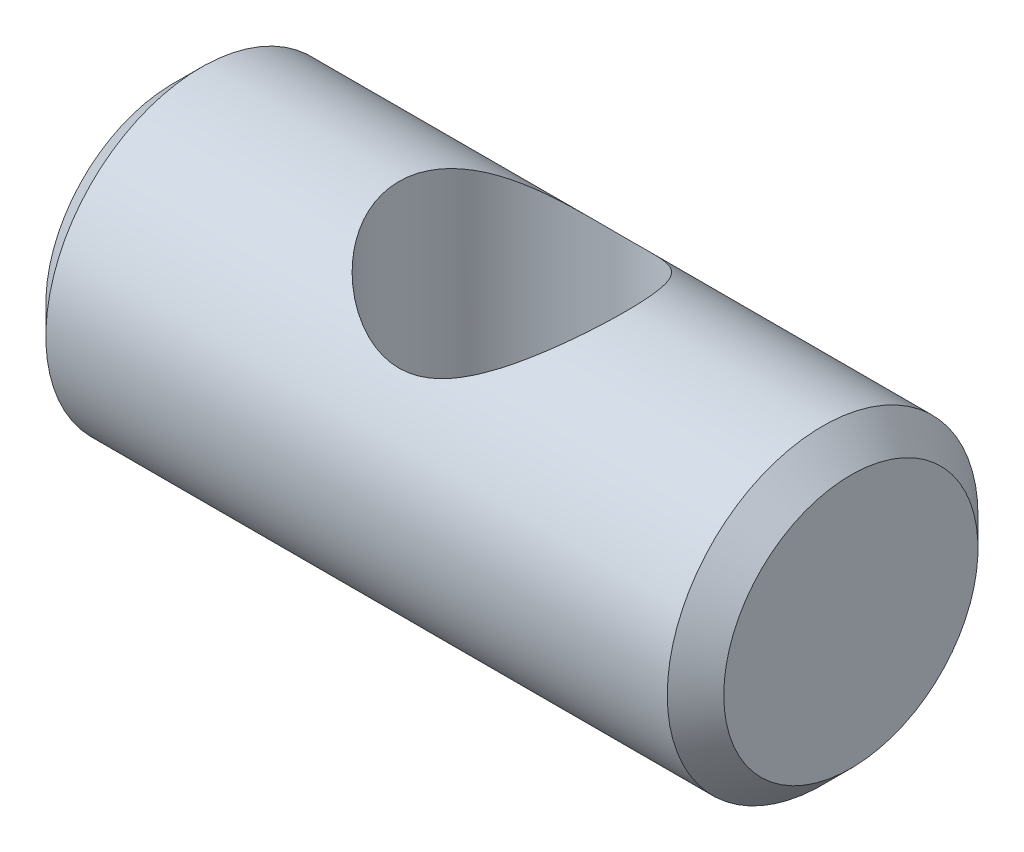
ISO-10303-21;
HEADER;
FILE_DESCRIPTION(('STEP AP214'),'2;1');
FILE_NAME('part.step','',(''),(''),'','','');
FILE_SCHEMA(('AUTOMOTIVE_DESIGN { 1 0 10303 214 1 1 1 1 }'));
ENDSEC;
DATA;
#1=APPLICATION_CONTEXT('core data for automotive mechanical design processes');
#2=APPLICATION_PROTOCOL_DEFINITION('international standard','automotive_design',2000,#1);
#3=PRODUCT_CONTEXT('',#1,'mechanical');
#4=PRODUCT('Part','Part','',(#3));
#5=PRODUCT_RELATED_PRODUCT_CATEGORY('part','',(#4));
#6=PRODUCT_DEFINITION_FORMATION('','',#4);
#7=PRODUCT_DEFINITION_CONTEXT('part definition',#1,'design');
#8=PRODUCT_DEFINITION('design','',#6,#7);
#9=PRODUCT_DEFINITION_SHAPE('','',#8);
#10=(LENGTH_UNIT() NAMED_UNIT(*) SI_UNIT(.MILLI.,.METRE.));
#11=(NAMED_UNIT(*) PLANE_ANGLE_UNIT() SI_UNIT($,.RADIAN.));
#12=(NAMED_UNIT(*) SI_UNIT($,.STERADIAN.) SOLID_ANGLE_UNIT());
#13=UNCERTAINTY_MEASURE_WITH_UNIT(LENGTH_MEASURE(1.E-05),#10,'distance_accuracy_value','');
#14=(GEOMETRIC_REPRESENTATION_CONTEXT(3) GLOBAL_UNCERTAINTY_ASSIGNED_CONTEXT((#13)) GLOBAL_UNIT_ASSIGNED_CONTEXT((#10,
#11,#12)) REPRESENTATION_CONTEXT('',''));
#15=CARTESIAN_POINT('',(0.,0.,0.));
#16=DIRECTION('',(0.,0.,1.));
#17=DIRECTION('',(1.,0.,0.));
#18=AXIS2_PLACEMENT_3D('',#15,#16,#17);
#19=CARTESIAN_POINT('',(12.,4.5,0.));
#20=DIRECTION('',(-1.,0.,0.));
#21=DIRECTION('',(0.,0.,1.));
#22=AXIS2_PLACEMENT_3D('',#19,#20,#21);
#23=PLANE('',#22);
#24=CARTESIAN_POINT('',(12.0000000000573,0.,0.));
#25=DIRECTION('',(-1.,0.,0.));
#26=DIRECTION('',(0.,0.,1.));
#27=AXIS2_PLACEMENT_3D('',#24,#25,#26);
#28=CIRCLE('',#27,4.49999999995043);
#29=CARTESIAN_POINT('',(12.0000000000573,0.,4.49999999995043));
#30=VERTEX_POINT('',#29);
#31=EDGE_CURVE('E62',#30,#30,#28,.T.);
#32=ORIENTED_EDGE('',*,*,#31,.F.);
#33=EDGE_LOOP('',(#32));
#34=FACE_BOUND('',#33,.T.);
#35=ADVANCED_FACE('F12',(#34),#23,.F.);
#36=CARTESIAN_POINT('',(-12.,0.,0.));
#37=DIRECTION('',(1.,0.,0.));
#38=DIRECTION('',(0.,0.,-1.));
#39=AXIS2_PLACEMENT_3D('',#36,#37,#38);
#40=PLANE('',#39);
#41=CARTESIAN_POINT('',(-11.9999999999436,0.,0.));
#42=DIRECTION('',(1.,0.,0.));
#43=DIRECTION('',(0.,0.,-1.));
#44=AXIS2_PLACEMENT_3D('',#41,#42,#43);
#45=CIRCLE('',#44,4.50000000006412);
#46=CARTESIAN_POINT('',(-11.9999999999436,0.,-4.50000000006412));
#47=VERTEX_POINT('',#46);
#48=EDGE_CURVE('E64',#47,#47,#45,.T.);
#49=ORIENTED_EDGE('',*,*,#48,.F.);
#50=EDGE_LOOP('',(#49));
#51=FACE_BOUND('',#50,.T.);
#52=ADVANCED_FACE('F53',(#51),#40,.F.);
#53=CARTESIAN_POINT('',(11.0000000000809,0.,0.));
#54=DIRECTION('',(-1.,0.,0.));
#55=DIRECTION('',(0.,0.,1.));
#56=AXIS2_PLACEMENT_3D('',#53,#54,#55);
#57=CONICAL_SURFACE('',#56,5.49999999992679,0.785398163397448);
#58=CARTESIAN_POINT('',(11.,0.,0.));
#59=DIRECTION('',(1.,0.,0.));
#60=DIRECTION('',(0.,0.,-1.));
#61=AXIS2_PLACEMENT_3D('',#58,#59,#60);
#62=CIRCLE('',#61,5.5);
#63=CARTESIAN_POINT('',(11.,0.,-5.5));
#64=VERTEX_POINT('',#63);
#65=EDGE_CURVE('E31',#64,#64,#62,.F.);
#66=ORIENTED_EDGE('',*,*,#65,.F.);
#67=EDGE_LOOP('',(#66));
#68=FACE_BOUND('',#67,.T.);
#69=ORIENTED_EDGE('',*,*,#31,.T.);
#70=EDGE_LOOP('',(#69));
#71=FACE_BOUND('',#70,.T.);
#72=ADVANCED_FACE('F58',(#68,#71),#57,.T.);
#73=CARTESIAN_POINT('',(-11.0000000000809,0.,0.));
#74=DIRECTION('',(1.,0.,0.));
#75=DIRECTION('',(0.,0.,-1.));
#76=AXIS2_PLACEMENT_3D('',#73,#74,#75);
#77=CONICAL_SURFACE('',#76,5.49999999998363,0.785398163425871);
#78=ORIENTED_EDGE('',*,*,#48,.T.);
#79=EDGE_LOOP('',(#78));
#80=FACE_BOUND('',#79,.T.);
#81=CARTESIAN_POINT('',(-11.,0.,0.));
#82=DIRECTION('',(1.,0.,0.));
#83=DIRECTION('',(0.,0.,-1.));
#84=AXIS2_PLACEMENT_3D('',#81,#82,#83);
#85=CIRCLE('',#84,5.5);
#86=CARTESIAN_POINT('',(-11.,0.,-5.5));
#87=VERTEX_POINT('',#86);
#88=EDGE_CURVE('E27',#87,#87,#85,.T.);
#89=ORIENTED_EDGE('',*,*,#88,.F.);
#90=EDGE_LOOP('',(#89));
#91=FACE_BOUND('',#90,.T.);
#92=ADVANCED_FACE('F50',(#80,#91),#77,.T.);
#93=CARTESIAN_POINT('',(12.,0.,0.));
#94=DIRECTION('',(1.,0.,0.));
#95=DIRECTION('',(0.,0.,-1.));
#96=AXIS2_PLACEMENT_3D('',#93,#94,#95);
#97=CYLINDRICAL_SURFACE('',#96,5.5);
#98=CARTESIAN_POINT('',(4.,-5.5,0.));
#99=CARTESIAN_POINT('',(3.99999899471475,-5.49999903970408,0.0984084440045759));
#100=CARTESIAN_POINT('',(3.99636152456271,-5.49735205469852,0.196846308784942));
#101=CARTESIAN_POINT('',(3.98186763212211,-5.48682476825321,0.392949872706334));
#102=CARTESIAN_POINT('',(3.97100665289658,-5.47894116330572,0.490615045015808));
#103=CARTESIAN_POINT('',(3.94220851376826,-5.45810479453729,0.684555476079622));
#104=CARTESIAN_POINT('',(3.92425716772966,-5.44514186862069,0.780827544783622));
#105=CARTESIAN_POINT('',(3.88155959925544,-5.41445183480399,0.971092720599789));
#106=CARTESIAN_POINT('',(3.85681035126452,-5.39672260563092,1.0650847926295));
#107=CARTESIAN_POINT('',(3.77322101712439,-5.33719436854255,1.34149727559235));
#108=CARTESIAN_POINT('',(3.7048263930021,-5.28889729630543,1.51974308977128));
#109=CARTESIAN_POINT('',(3.54570801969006,-5.17868357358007,1.86104833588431));
#110=CARTESIAN_POINT('',(3.45499170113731,-5.11677145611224,2.02411279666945));
#111=CARTESIAN_POINT('',(3.24498611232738,-4.97726899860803,2.34745196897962));
#112=CARTESIAN_POINT('',(3.12384867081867,-4.89876490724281,2.50612448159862));
#113=CARTESIAN_POINT('',(2.86114554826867,-4.735556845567,2.80234464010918));
#114=CARTESIAN_POINT('',(2.71954756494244,-4.65084317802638,2.93985815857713));
#115=CARTESIAN_POINT('',(2.47894022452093,-4.51549142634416,3.14142944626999));
#116=CARTESIAN_POINT('',(2.38584323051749,-4.46491683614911,3.21271520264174));
#117=CARTESIAN_POINT('',(2.1932384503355,-4.36503158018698,3.34716368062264));
#118=CARTESIAN_POINT('',(2.0937288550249,-4.31572127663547,3.41032409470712));
#119=CARTESIAN_POINT('',(1.8885986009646,-4.22002309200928,3.52805237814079));
#120=CARTESIAN_POINT('',(1.78298638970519,-4.17363134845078,3.58263175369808));
#121=CARTESIAN_POINT('',(1.56573311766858,-4.08554066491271,3.68277103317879));
#122=CARTESIAN_POINT('',(1.45409308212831,-4.04384093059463,3.72833246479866));
#123=CARTESIAN_POINT('',(1.18594942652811,-3.95419172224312,3.82361059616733));
#124=CARTESIAN_POINT('',(1.02708689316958,-3.90893007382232,3.86948259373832));
#125=CARTESIAN_POINT('',(0.782796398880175,-3.85440723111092,3.92354368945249));
#126=CARTESIAN_POINT('',(0.700413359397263,-3.83846627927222,3.93910176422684));
#127=CARTESIAN_POINT('',(0.534038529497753,-3.81162335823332,3.96508247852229));
#128=CARTESIAN_POINT('',(0.450047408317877,-3.80071933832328,3.97550720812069));
#129=CARTESIAN_POINT('',(0.28038994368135,-3.78436723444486,3.99107685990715));
#130=CARTESIAN_POINT('',(0.194715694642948,-3.77896160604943,3.99618070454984));
#131=CARTESIAN_POINT('',(0.0230469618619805,-3.77401268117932,4.00085496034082));
#132=CARTESIAN_POINT('',(-0.0629475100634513,-3.77446917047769,4.00042557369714));
#133=CARTESIAN_POINT('',(-0.234534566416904,-3.78122375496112,3.9940415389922));
#134=CARTESIAN_POINT('',(-0.320126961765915,-3.78752436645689,3.98808451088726));
#135=CARTESIAN_POINT('',(-0.490201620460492,-3.80567208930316,3.97077015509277));
#136=CARTESIAN_POINT('',(-0.574683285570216,-3.81752207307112,3.95941003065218));
#137=CARTESIAN_POINT('',(-0.751501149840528,-3.84789873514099,3.9299073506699));
#138=CARTESIAN_POINT('',(-0.84362776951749,-3.86703500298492,3.91113665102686));
#139=CARTESIAN_POINT('',(-1.02516088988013,-3.91064916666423,3.86752833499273));
#140=CARTESIAN_POINT('',(-1.1145655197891,-3.93513064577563,3.84268664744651));
#141=CARTESIAN_POINT('',(-1.37835251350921,-4.01518937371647,3.75954096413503));
#142=CARTESIAN_POINT('',(-1.54812080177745,-4.07734524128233,3.69264874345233));
#143=CARTESIAN_POINT('',(-1.81959122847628,-4.18940076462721,3.5642123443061));
#144=CARTESIAN_POINT('',(-1.92521790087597,-4.23654386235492,3.50823146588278));
#145=CARTESIAN_POINT('',(-2.13020845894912,-4.33354849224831,3.38767435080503));
#146=CARTESIAN_POINT('',(-2.22957064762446,-4.38341075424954,3.32309579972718));
#147=CARTESIAN_POINT('',(-2.42189227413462,-4.48428947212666,3.18565928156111));
#148=CARTESIAN_POINT('',(-2.51484622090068,-4.53530686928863,3.11279435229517));
#149=CARTESIAN_POINT('',(-2.69405037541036,-4.63707579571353,2.95905843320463));
#150=CARTESIAN_POINT('',(-2.78030031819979,-4.68782731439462,2.87818712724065));
#151=CARTESIAN_POINT('',(-2.94678613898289,-4.78843347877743,2.70755212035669));
#152=CARTESIAN_POINT('',(-3.0269315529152,-4.83826850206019,2.61768838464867));
#153=CARTESIAN_POINT('',(-3.17943947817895,-4.93511583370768,2.43017835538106));
#154=CARTESIAN_POINT('',(-3.25180303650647,-4.98212852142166,2.33253311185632));
#155=CARTESIAN_POINT('',(-3.38795931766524,-5.07204693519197,2.12992764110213));
#156=CARTESIAN_POINT('',(-3.45176745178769,-5.11496000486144,2.02498109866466));
#157=CARTESIAN_POINT('',(-3.57012808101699,-5.19556941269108,1.80816162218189));
#158=CARTESIAN_POINT('',(-3.62468405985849,-5.23326771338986,1.69629131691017));
#159=CARTESIAN_POINT('',(-3.74778284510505,-5.31912327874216,1.41021717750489));
#160=CARTESIAN_POINT('',(-3.81023559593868,-5.36345823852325,1.2321446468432));
#161=CARTESIAN_POINT('',(-3.90978556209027,-5.43463079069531,0.865776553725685));
#162=CARTESIAN_POINT('',(-3.94690145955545,-5.46148127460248,0.67748863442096));
#163=CARTESIAN_POINT('',(-3.99376924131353,-5.4954458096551,0.295007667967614));
#164=CARTESIAN_POINT('',(-4.00342107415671,-5.50248769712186,0.100795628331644));
#165=CARTESIAN_POINT('',(-3.99442043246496,-5.49594258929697,-0.286621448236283));
#166=CARTESIAN_POINT('',(-3.97576673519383,-5.48235470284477,-0.479826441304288));
#167=CARTESIAN_POINT('',(-3.91319900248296,-5.43715890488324,-0.848454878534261));
#168=CARTESIAN_POINT('',(-3.87076622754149,-5.40660857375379,-1.02426702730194));
#169=CARTESIAN_POINT('',(-3.76391863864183,-5.33063562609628,-1.36562564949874));
#170=CARTESIAN_POINT('',(-3.69949926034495,-5.2852099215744,-1.53116998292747));
#171=CARTESIAN_POINT('',(-3.54500864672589,-5.17819647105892,-1.86254817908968));
#172=CARTESIAN_POINT('',(-3.45324469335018,-5.11557595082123,-2.02725211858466));
#173=CARTESIAN_POINT('',(-3.24986864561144,-4.98054847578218,-2.33947109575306));
#174=CARTESIAN_POINT('',(-3.13824329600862,-4.90813499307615,-2.48697454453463));
#175=CARTESIAN_POINT('',(-2.87547207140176,-4.74403863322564,-2.78904311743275));
#176=CARTESIAN_POINT('',(-2.72083192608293,-4.65125321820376,-2.9399691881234));
#177=CARTESIAN_POINT('',(-2.38933728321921,-4.46542541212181,-3.2152051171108));
#178=CARTESIAN_POINT('',(-2.21246506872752,-4.37238287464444,-3.33949353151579));
#179=CARTESIAN_POINT('',(-1.86022272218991,-4.20586816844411,-3.54628148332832));
#180=CARTESIAN_POINT('',(-1.68723359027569,-4.13138834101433,-3.63201008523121));
#181=CARTESIAN_POINT('',(-1.32574742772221,-3.99745252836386,-3.77892413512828));
#182=CARTESIAN_POINT('',(-1.13728383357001,-3.93796522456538,-3.84016090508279));
#183=CARTESIAN_POINT('',(-0.789453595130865,-3.85373689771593,-3.92447442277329));
#184=CARTESIAN_POINT('',(-0.632566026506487,-3.82427115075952,-3.95293016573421));
#185=CARTESIAN_POINT('',(-0.314189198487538,-3.78469363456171,-3.99085072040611));
#186=CARTESIAN_POINT('',(-0.152706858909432,-3.77455417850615,-4.00034270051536));
#187=CARTESIAN_POINT('',(0.170405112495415,-3.77530099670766,-3.9996377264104));
#188=CARTESIAN_POINT('',(0.332034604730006,-3.786218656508,-3.98941138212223));
#189=CARTESIAN_POINT('',(0.650555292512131,-3.82728792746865,-3.95001664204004));
#190=CARTESIAN_POINT('',(0.807438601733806,-3.85746988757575,-3.92081835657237));
#191=CARTESIAN_POINT('',(1.15974890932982,-3.94430870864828,-3.83369579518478));
#192=CARTESIAN_POINT('',(1.35235018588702,-4.00623096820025,-3.76972865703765));
#193=CARTESIAN_POINT('',(1.72116198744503,-4.14523984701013,-3.61630704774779));
#194=CARTESIAN_POINT('',(1.89734420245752,-4.22235196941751,-3.5268095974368));
#195=CARTESIAN_POINT('',(2.23742741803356,-4.38556998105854,-3.32181769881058));
#196=CARTESIAN_POINT('',(2.4008161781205,-4.47187341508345,-3.20563731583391));
#197=CARTESIAN_POINT('',(2.70864188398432,-4.64440662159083,-2.95012732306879));
#198=CARTESIAN_POINT('',(2.85307097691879,-4.73063634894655,-2.81078817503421));
#199=CARTESIAN_POINT('',(3.06853788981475,-4.86434742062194,-2.56887263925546));
#200=CARTESIAN_POINT('',(3.1462007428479,-4.91380339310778,-2.47320695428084));
#201=CARTESIAN_POINT('',(3.29313709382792,-5.00915341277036,-2.27388986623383));
#202=CARTESIAN_POINT('',(3.3624087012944,-5.05504665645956,-2.17023667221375));
#203=CARTESIAN_POINT('',(3.49166326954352,-5.14192851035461,-1.95549931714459));
#204=CARTESIAN_POINT('',(3.55165540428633,-5.18292195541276,-1.84442265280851));
#205=CARTESIAN_POINT('',(3.66149903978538,-5.25880189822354,-1.61540436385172));
#206=CARTESIAN_POINT('',(3.71135581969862,-5.29369157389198,-1.49746635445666));
#207=CARTESIAN_POINT('',(3.78737372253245,-5.34730754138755,-1.29007572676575));
#208=CARTESIAN_POINT('',(3.81624110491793,-5.36780854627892,-1.20206275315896));
#209=CARTESIAN_POINT('',(3.86796791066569,-5.40470593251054,-1.02345557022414));
#210=CARTESIAN_POINT('',(3.89082875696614,-5.42110328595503,-0.932861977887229));
#211=CARTESIAN_POINT('',(3.93019600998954,-5.44942698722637,-0.749865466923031));
#212=CARTESIAN_POINT('',(3.94671849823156,-5.46136464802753,-0.657467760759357));
#213=CARTESIAN_POINT('',(3.97324948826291,-5.48056812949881,-0.471295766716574));
#214=CARTESIAN_POINT('',(3.98326153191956,-5.48783649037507,-0.377522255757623));
#215=CARTESIAN_POINT('',(3.9932941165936,-5.49512453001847,-0.236296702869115));
#216=CARTESIAN_POINT('',(3.99580740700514,-5.49695146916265,-0.189097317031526));
#217=CARTESIAN_POINT('',(3.99916071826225,-5.4993895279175,-0.0946008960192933));
#218=CARTESIAN_POINT('',(4.00000048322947,-5.50000046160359,-0.0473038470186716));
#219=CARTESIAN_POINT('',(4.,-5.5,0.));
#220=B_SPLINE_CURVE_WITH_KNOTS('',3,(#98,#99,#100,#101,#102,#103,#104,#105,#106,#107,#108,#109,
#110,#111,#112,#113,#114,#115,#116,#117,#118,#119,#120,#121,#122,#123,#124,#125,#126,#127,#128,
#129,#130,#131,#132,#133,#134,#135,#136,#137,#138,#139,#140,#141,#142,#143,#144,#145,#146,#147,
#148,#149,#150,#151,#152,#153,#154,#155,#156,#157,#158,#159,#160,#161,#162,#163,#164,#165,#166,
#167,#168,#169,#170,#171,#172,#173,#174,#175,#176,#177,#178,#179,#180,#181,#182,#183,#184,#185,
#186,#187,#188,#189,#190,#191,#192,#193,#194,#195,#196,#197,#198,#199,#200,#201,#202,#203,#204,
#205,#206,#207,#208,#209,#210,#211,#212,#213,#214,#215,#216,#217,#218,#219),.UNSPECIFIED.,.T.,
.F.,(4,2,2,2,2,2,2,2,2,2,2,2,2,2,2,2,2,2,2,2,2,2,2,2,2,2,2,2,2,2,2,2,2,2,2,2,2,2,2,2,2,2,2,2,2,
2,2,2,2,2,2,2,2,2,2,2,2,2,2,2,4),(0.,0.295173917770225,0.590534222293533,0.886488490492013,
1.18257469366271,1.77055979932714,2.35834943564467,2.99959161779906,3.64185745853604,
4.02458431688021,4.40741962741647,4.78973713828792,5.1719898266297,5.68407429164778,
5.9398376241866,6.19549673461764,6.45311525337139,6.71072435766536,6.96844443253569,
7.22629805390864,7.51370613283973,7.80130747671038,8.37708279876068,8.76220665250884,
9.14743438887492,9.53298821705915,9.91855727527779,10.3090312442,10.6994526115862,
11.0891609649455,11.4787222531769,12.0576277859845,12.6361059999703,13.2166889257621,
13.7972969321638,14.3452171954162,14.8932512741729,15.4870438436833,16.0812341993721,
16.7840549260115,17.4874393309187,18.1061725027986,18.7236022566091,19.2080094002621,
19.6917220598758,20.1761562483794,20.6613555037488,21.2944341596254,21.9285849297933,
22.5813485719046,23.2343817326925,23.6322360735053,24.0301798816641,24.4277277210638,
24.8250679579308,25.1093874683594,25.3936395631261,25.6771656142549,25.9605372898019,
26.1024024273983,26.244289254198),.UNSPECIFIED.);
#221=CARTESIAN_POINT('',(4.,-5.5,0.));
#222=VERTEX_POINT('',#221);
#223=EDGE_CURVE('E8',#222,#222,#220,.T.);
#224=ORIENTED_EDGE('',*,*,#223,.F.);
#225=EDGE_LOOP('',(#224));
#226=FACE_BOUND('',#225,.T.);
#227=CARTESIAN_POINT('',(0.,3.77491721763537,4.));
#228=CARTESIAN_POINT('',(0.0945596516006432,3.77491776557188,3.99999971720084));
#229=CARTESIAN_POINT('',(0.189122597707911,3.77848849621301,3.99663873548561));
#230=CARTESIAN_POINT('',(0.377297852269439,3.79256375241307,3.98328406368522));
#231=CARTESIAN_POINT('',(0.470909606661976,3.80307210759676,3.97328671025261));
#232=CARTESIAN_POINT('',(0.656483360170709,3.83047325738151,3.94687649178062));
#233=CARTESIAN_POINT('',(0.748441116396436,3.84738053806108,3.93044906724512));
#234=CARTESIAN_POINT('',(0.929870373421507,3.88674704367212,3.89152450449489));
#235=CARTESIAN_POINT('',(1.01934036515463,3.90920956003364,3.86902376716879));
#236=CARTESIAN_POINT('',(1.28093397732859,3.98284505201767,3.79365509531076));
#237=CARTESIAN_POINT('',(1.44885844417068,4.04070094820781,3.73252985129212));
#238=CARTESIAN_POINT('',(1.7714629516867,4.16725067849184,3.590688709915));
#239=CARTESIAN_POINT('',(1.92614400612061,4.23594368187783,3.50997431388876));
#240=CARTESIAN_POINT('',(2.25065582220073,4.39220950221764,3.31318173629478));
#241=CARTESIAN_POINT('',(2.41764951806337,4.48086750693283,3.19328494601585));
#242=CARTESIAN_POINT('',(2.73178094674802,4.65787607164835,2.92908108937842));
#243=CARTESIAN_POINT('',(2.87889125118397,4.74622604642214,2.78474090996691));
#244=CARTESIAN_POINT('',(3.09553636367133,4.88143539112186,2.5362822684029));
#245=CARTESIAN_POINT('',(3.17231415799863,4.9305740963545,2.43963284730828));
#246=CARTESIAN_POINT('',(3.31733570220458,5.02510545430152,2.23844845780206));
#247=CARTESIAN_POINT('',(3.38558334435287,5.07049981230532,2.13391712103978));
#248=CARTESIAN_POINT('',(3.51266692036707,5.15622286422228,1.91752007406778));
#249=CARTESIAN_POINT('',(3.57151627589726,5.19655876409,1.80566515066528));
#250=CARTESIAN_POINT('',(3.67896799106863,5.27098737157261,1.57523382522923));
#251=CARTESIAN_POINT('',(3.72757531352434,5.30508310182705,1.45666071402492));
#252=CARTESIAN_POINT('',(3.83193503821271,5.378830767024,1.16188171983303));
#253=CARTESIAN_POINT('',(3.88193864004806,5.41468159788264,0.982606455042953));
#254=CARTESIAN_POINT('',(3.95663720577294,5.4684829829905,0.616370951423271));
#255=CARTESIAN_POINT('',(3.98135342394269,5.4864485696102,0.429417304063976));
#256=CARTESIAN_POINT('',(4.00411402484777,5.50298682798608,0.0525678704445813));
#257=CARTESIAN_POINT('',(4.00209732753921,5.50151508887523,-0.137333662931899));
#258=CARTESIAN_POINT('',(3.97135939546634,5.47919582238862,-0.51380986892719));
#259=CARTESIAN_POINT('',(3.94263129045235,5.45834331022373,-0.700383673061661));
#260=CARTESIAN_POINT('',(3.86136821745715,5.39994417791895,-1.05962164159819));
#261=CARTESIAN_POINT('',(3.80954610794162,5.36289802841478,-1.23253206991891));
#262=CARTESIAN_POINT('',(3.68473335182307,5.27496945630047,-1.56671343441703));
#263=CARTESIAN_POINT('',(3.61173839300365,5.22408421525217,-1.72798199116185));
#264=CARTESIAN_POINT('',(3.43803005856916,5.10544566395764,-2.05370310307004));
#265=CARTESIAN_POINT('',(3.33514439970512,5.03644942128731,-2.2165364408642));
#266=CARTESIAN_POINT('',(3.10940476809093,4.88988998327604,-2.52348319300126));
#267=CARTESIAN_POINT('',(2.98653148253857,4.81231852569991,-2.66757825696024));
#268=CARTESIAN_POINT('',(2.69807007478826,4.63830410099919,-2.9615059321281));
#269=CARTESIAN_POINT('',(2.52879913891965,4.54106850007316,-3.10726104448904));
#270=CARTESIAN_POINT('',(2.16705523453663,4.3499971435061,-3.36953999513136));
#271=CARTESIAN_POINT('',(1.97457895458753,4.25616187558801,-3.48605965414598));
#272=CARTESIAN_POINT('',(1.61165125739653,4.10203228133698,-3.66526169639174));
#273=CARTESIAN_POINT('',(1.44549066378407,4.03887896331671,-3.73414032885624));
#274=CARTESIAN_POINT('',(1.10068331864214,3.92874308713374,-3.84985589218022));
#275=CARTESIAN_POINT('',(0.922065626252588,3.88172431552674,-3.8967422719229));
#276=CARTESIAN_POINT('',(0.585461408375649,3.81709060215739,-3.95999371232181));
#277=CARTESIAN_POINT('',(0.428880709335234,3.79592350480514,-3.98009730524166));
#278=CARTESIAN_POINT('',(0.113064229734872,3.77333697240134,-4.00152507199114));
#279=CARTESIAN_POINT('',(-0.046169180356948,3.77190076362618,-4.00286519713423));
#280=CARTESIAN_POINT('',(-0.362327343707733,3.78897679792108,-3.98669865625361));
#281=CARTESIAN_POINT('',(-0.519254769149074,3.80746374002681,-3.96921589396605));
#282=CARTESIAN_POINT('',(-0.82717652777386,3.86149165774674,-3.91666535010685));
#283=CARTESIAN_POINT('',(-0.978161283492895,3.89705903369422,-3.88157034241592));
#284=CARTESIAN_POINT('',(-1.33113055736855,3.99784696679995,-3.77812999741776));
#285=CARTESIAN_POINT('',(-1.52906623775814,4.06924236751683,-3.70207893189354));
#286=CARTESIAN_POINT('',(-1.90640842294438,4.22548400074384,-3.522705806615));
#287=CARTESIAN_POINT('',(-2.08577687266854,4.31035698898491,-3.41932922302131));
#288=CARTESIAN_POINT('',(-2.43025180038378,4.48705740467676,-3.18411833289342));
#289=CARTESIAN_POINT('',(-2.59477148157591,4.57901689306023,-3.05152555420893));
#290=CARTESIAN_POINT('',(-2.90173861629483,4.75969946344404,-2.76125147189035));
#291=CARTESIAN_POINT('',(-3.04420434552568,4.84842517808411,-2.6035911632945));
#292=CARTESIAN_POINT('',(-3.2987599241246,5.01226311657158,-2.271539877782));
#293=CARTESIAN_POINT('',(-3.41190835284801,5.08780186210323,-2.09818660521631));
#294=CARTESIAN_POINT('',(-3.56180731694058,5.18990868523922,-1.82330793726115));
#295=CARTESIAN_POINT('',(-3.6084863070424,5.22208942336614,-1.72916099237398));
#296=CARTESIAN_POINT('',(-3.69470582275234,5.28203430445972,-1.53632285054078));
#297=CARTESIAN_POINT('',(-3.73424977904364,5.30980056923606,-1.43763386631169));
#298=CARTESIAN_POINT('',(-3.80598862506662,5.36049441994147,-1.23534308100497));
#299=CARTESIAN_POINT('',(-3.83811376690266,5.38337594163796,-1.13170490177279));
#300=CARTESIAN_POINT('',(-3.89401032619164,5.42336931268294,-0.921160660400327));
#301=CARTESIAN_POINT('',(-3.9177861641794,5.44048421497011,-0.814256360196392));
#302=CARTESIAN_POINT('',(-3.95655048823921,5.46846521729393,-0.598125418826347));
#303=CARTESIAN_POINT('',(-3.9715445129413,5.47933525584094,-0.488900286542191));
#304=CARTESIAN_POINT('',(-3.9924605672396,5.49451442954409,-0.269138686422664));
#305=CARTESIAN_POINT('',(-3.99838404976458,5.49882461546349,-0.158602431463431));
#306=CARTESIAN_POINT('',(-4.00084937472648,5.50061786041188,0.0467313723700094));
#307=CARTESIAN_POINT('',(-3.99861635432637,5.49899247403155,0.141509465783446));
#308=CARTESIAN_POINT('',(-3.98744748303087,5.49087629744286,0.330490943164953));
#309=CARTESIAN_POINT('',(-3.97850957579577,5.4843840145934,0.424694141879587));
#310=CARTESIAN_POINT('',(-3.95406659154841,5.46667824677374,0.611759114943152));
#311=CARTESIAN_POINT('',(-3.93856396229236,5.45546652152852,0.70462137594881));
#312=CARTESIAN_POINT('',(-3.90122128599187,5.4285691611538,0.888415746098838));
#313=CARTESIAN_POINT('',(-3.87937877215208,5.41288178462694,0.979347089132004));
#314=CARTESIAN_POINT('',(-3.80583624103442,5.36033634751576,1.24445933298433));
#315=CARTESIAN_POINT('',(-3.74554675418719,5.31757017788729,1.41518501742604));
#316=CARTESIAN_POINT('',(-3.60438289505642,5.21910224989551,1.74369677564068));
#317=CARTESIAN_POINT('',(-3.5235051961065,5.16339840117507,1.90148075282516));
#318=CARTESIAN_POINT('',(-3.33179335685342,5.03439725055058,2.22228203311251));
#319=CARTESIAN_POINT('',(-3.21841054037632,4.95974698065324,2.38322541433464));
#320=CARTESIAN_POINT('',(-2.97136345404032,4.80310618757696,2.68497920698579));
#321=CARTESIAN_POINT('',(-2.8376718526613,4.72110583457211,2.82576198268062));
#322=CARTESIAN_POINT('',(-2.61000808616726,4.58883329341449,3.03332548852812));
#323=CARTESIAN_POINT('',(-2.5218601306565,4.53915210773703,3.10699576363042));
#324=CARTESIAN_POINT('',(-2.3393224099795,4.44032981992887,3.24665706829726));
#325=CARTESIAN_POINT('',(-2.24493107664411,4.39118885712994,3.31264615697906));
#326=CARTESIAN_POINT('',(-2.05014191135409,4.29487192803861,3.43660180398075));
#327=CARTESIAN_POINT('',(-1.94974758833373,4.24769484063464,3.49457298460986));
#328=CARTESIAN_POINT('',(-1.74306577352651,4.15687954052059,3.60212550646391));
#329=CARTESIAN_POINT('',(-1.6367786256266,4.11324112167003,3.65170733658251));
#330=CARTESIAN_POINT('',(-1.37275858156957,4.01421622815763,3.76078752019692));
#331=CARTESIAN_POINT('',(-1.21205137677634,3.96151667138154,3.81580236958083));
#332=CARTESIAN_POINT('',(-0.963817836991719,3.89520189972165,3.88309107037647));
#333=CARTESIAN_POINT('',(-0.879972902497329,3.87523421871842,3.90296834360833));
#334=CARTESIAN_POINT('',(-0.710192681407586,3.84024545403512,3.93739985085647));
#335=CARTESIAN_POINT('',(-0.62425835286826,3.82522214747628,3.95195647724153));
#336=CARTESIAN_POINT('',(-0.449073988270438,3.80052630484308,3.97571410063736));
#337=CARTESIAN_POINT('',(-0.359792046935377,3.79096825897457,3.98480070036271));
#338=CARTESIAN_POINT('',(-0.180341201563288,3.77816272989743,3.99694447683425));
#339=CARTESIAN_POINT('',(-0.0901720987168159,3.77491669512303,4.00000026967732));
#340=CARTESIAN_POINT('',(0.,3.77491721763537,4.));
#341=B_SPLINE_CURVE_WITH_KNOTS('',3,(#227,#228,#229,#230,#231,#232,#233,#234,#235,#236,#237,
#238,#239,#240,#241,#242,#243,#244,#245,#246,#247,#248,#249,#250,#251,#252,#253,#254,#255,#256,
#257,#258,#259,#260,#261,#262,#263,#264,#265,#266,#267,#268,#269,#270,#271,#272,#273,#274,#275,
#276,#277,#278,#279,#280,#281,#282,#283,#284,#285,#286,#287,#288,#289,#290,#291,#292,#293,#294,
#295,#296,#297,#298,#299,#300,#301,#302,#303,#304,#305,#306,#307,#308,#309,#310,#311,#312,#313,
#314,#315,#316,#317,#318,#319,#320,#321,#322,#323,#324,#325,#326,#327,#328,#329,#330,#331,#332,
#333,#334,#335,#336,#337,#338,#339,#340),.UNSPECIFIED.,.T.,.F.,(4,2,2,2,2,2,2,2,2,2,2,2,2,2,2,2,
2,2,2,2,2,2,2,2,2,2,2,2,2,2,2,2,2,2,2,2,2,2,2,2,2,2,2,2,2,2,2,2,2,2,2,2,2,2,2,2,4),(0.,
0.283560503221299,0.567277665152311,0.851640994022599,1.13617321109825,1.69729774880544,
2.25837929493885,2.92774006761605,3.59801497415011,3.99610080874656,4.39400433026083,
4.79133442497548,5.18847154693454,5.75445889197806,6.31997012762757,6.88677367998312,
7.45372305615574,8.00426875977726,8.5549266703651,9.16646484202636,9.77859745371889,
10.5066073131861,11.2347211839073,11.8047550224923,12.3735009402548,12.8491941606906,
13.3244829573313,13.7991688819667,14.2745908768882,14.94214771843,15.6110467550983,
16.2999460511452,16.9882713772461,17.6463931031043,17.9757519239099,18.3049519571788,
18.6371312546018,18.9691344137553,19.3009279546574,19.6326683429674,19.9167672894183,
20.2009534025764,20.4850336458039,20.7692245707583,21.3249022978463,21.8806698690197,
22.5100347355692,23.1402542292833,23.5154020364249,23.8906444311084,24.2656695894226,
24.6406728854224,25.1720162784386,25.4371121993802,25.7020887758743,25.9724300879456,
26.24283342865),.UNSPECIFIED.);
#342=CARTESIAN_POINT('',(0.,3.77491721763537,4.));
#343=VERTEX_POINT('',#342);
#344=EDGE_CURVE('E23',#343,#343,#341,.T.);
#345=ORIENTED_EDGE('',*,*,#344,.F.);
#346=EDGE_LOOP('',(#345));
#347=FACE_BOUND('',#346,.T.);
#348=ORIENTED_EDGE('',*,*,#88,.T.);
#349=EDGE_LOOP('',(#348));
#350=FACE_BOUND('',#349,.T.);
#351=ORIENTED_EDGE('',*,*,#65,.T.);
#352=EDGE_LOOP('',(#351));
#353=FACE_BOUND('',#352,.T.);
#354=ADVANCED_FACE('F39',(#226,#347,#350,#353),#97,.T.);
#355=CARTESIAN_POINT('',(0.,-5.5,0.));
#356=DIRECTION('',(0.,1.,0.));
#357=DIRECTION('',(0.,0.,1.));
#358=AXIS2_PLACEMENT_3D('',#355,#356,#357);
#359=CYLINDRICAL_SURFACE('',#358,4.);
#360=ORIENTED_EDGE('',*,*,#223,.T.);
#361=EDGE_LOOP('',(#360));
#362=FACE_BOUND('',#361,.T.);
#363=ORIENTED_EDGE('',*,*,#344,.T.);
#364=EDGE_LOOP('',(#363));
#365=FACE_BOUND('',#364,.T.);
#366=ADVANCED_FACE('F42',(#362,#365),#359,.F.);
#367=CLOSED_SHELL('',(#35,#52,#72,#92,#354,#366));
#368=MANIFOLD_SOLID_BREP('B1',#367);
#369=ADVANCED_BREP_SHAPE_REPRESENTATION('',(#18,#368),#14);
#370=SHAPE_DEFINITION_REPRESENTATION(#9,#369);
ENDSEC;
END-ISO-10303-21;
